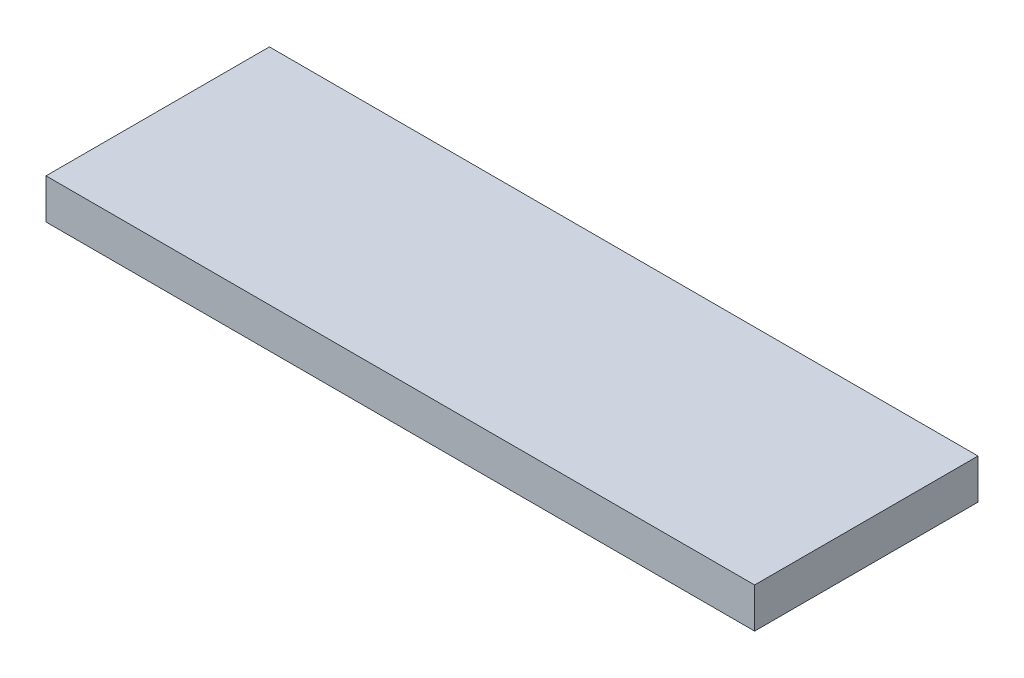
ISO-10303-21;
HEADER;
FILE_DESCRIPTION(('STEP AP214'),'2;1');
FILE_NAME('part.step','',(''),(''),'','','');
FILE_SCHEMA(('AUTOMOTIVE_DESIGN { 1 0 10303 214 1 1 1 1 }'));
ENDSEC;
DATA;
#1=APPLICATION_CONTEXT('core data for automotive mechanical design processes');
#2=APPLICATION_PROTOCOL_DEFINITION('international standard','automotive_design',2000,#1);
#3=PRODUCT_CONTEXT('',#1,'mechanical');
#4=PRODUCT('Part','Part','',(#3));
#5=PRODUCT_RELATED_PRODUCT_CATEGORY('part','',(#4));
#6=PRODUCT_DEFINITION_FORMATION('','',#4);
#7=PRODUCT_DEFINITION_CONTEXT('part definition',#1,'design');
#8=PRODUCT_DEFINITION('design','',#6,#7);
#9=PRODUCT_DEFINITION_SHAPE('','',#8);
#10=(LENGTH_UNIT() NAMED_UNIT(*) SI_UNIT(.MILLI.,.METRE.));
#11=(NAMED_UNIT(*) PLANE_ANGLE_UNIT() SI_UNIT($,.RADIAN.));
#12=(NAMED_UNIT(*) SI_UNIT($,.STERADIAN.) SOLID_ANGLE_UNIT());
#13=UNCERTAINTY_MEASURE_WITH_UNIT(LENGTH_MEASURE(1.E-05),#10,'distance_accuracy_value','');
#14=(GEOMETRIC_REPRESENTATION_CONTEXT(3) GLOBAL_UNCERTAINTY_ASSIGNED_CONTEXT((#13)) GLOBAL_UNIT_ASSIGNED_CONTEXT((#10,
#11,#12)) REPRESENTATION_CONTEXT('',''));
#15=CARTESIAN_POINT('',(0.,0.,0.));
#16=DIRECTION('',(0.,0.,1.));
#17=DIRECTION('',(1.,0.,0.));
#18=AXIS2_PLACEMENT_3D('',#15,#16,#17);
#19=CARTESIAN_POINT('',(0.,0.,131.064));
#20=DIRECTION('',(1.,0.,0.));
#21=DIRECTION('',(0.,0.,-1.));
#22=AXIS2_PLACEMENT_3D('',#19,#20,#21);
#23=PLANE('',#22);
#24=DIRECTION('',(0.,-1.,0.));
#25=VECTOR('',#24,1.);
#26=CARTESIAN_POINT('',(0.,0.,0.));
#27=LINE('',#26,#25);
#28=CARTESIAN_POINT('',(0.,23.458279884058,0.));
#29=VERTEX_POINT('',#28);
#30=CARTESIAN_POINT('',(0.,0.,0.));
#31=VERTEX_POINT('',#30);
#32=EDGE_CURVE('E94',#29,#31,#27,.T.);
#33=ORIENTED_EDGE('',*,*,#32,.T.);
#34=DIRECTION('',(0.,0.,-1.));
#35=VECTOR('',#34,1.);
#36=CARTESIAN_POINT('',(0.,0.,131.064));
#37=LINE('',#36,#35);
#38=CARTESIAN_POINT('',(0.,0.,131.064));
#39=VERTEX_POINT('',#38);
#40=EDGE_CURVE('E11',#39,#31,#37,.T.);
#41=ORIENTED_EDGE('',*,*,#40,.F.);
#42=DIRECTION('',(0.,-1.,0.));
#43=VECTOR('',#42,1.);
#44=CARTESIAN_POINT('',(0.,0.,131.064));
#45=LINE('',#44,#43);
#46=CARTESIAN_POINT('',(0.,23.458279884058,131.064));
#47=VERTEX_POINT('',#46);
#48=EDGE_CURVE('E82',#47,#39,#45,.T.);
#49=ORIENTED_EDGE('',*,*,#48,.F.);
#50=DIRECTION('',(0.,0.,-1.));
#51=VECTOR('',#50,1.);
#52=CARTESIAN_POINT('',(0.,23.458279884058,131.064));
#53=LINE('',#52,#51);
#54=EDGE_CURVE('E90',#47,#29,#53,.T.);
#55=ORIENTED_EDGE('',*,*,#54,.T.);
#56=EDGE_LOOP('',(#33,#41,#49,#55));
#57=FACE_BOUND('',#56,.T.);
#58=ADVANCED_FACE('F31',(#57),#23,.F.);
#59=CARTESIAN_POINT('',(0.,0.,131.064));
#60=DIRECTION('',(0.,1.,0.));
#61=DIRECTION('',(0.,0.,1.));
#62=AXIS2_PLACEMENT_3D('',#59,#60,#61);
#63=PLANE('',#62);
#64=DIRECTION('',(1.,0.,0.));
#65=VECTOR('',#64,1.);
#66=CARTESIAN_POINT('',(0.,0.,0.));
#67=LINE('',#66,#65);
#68=CARTESIAN_POINT('',(415.761360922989,0.,0.));
#69=VERTEX_POINT('',#68);
#70=EDGE_CURVE('E86',#31,#69,#67,.T.);
#71=ORIENTED_EDGE('',*,*,#70,.T.);
#72=DIRECTION('',(0.,0.,-1.));
#73=VECTOR('',#72,1.);
#74=CARTESIAN_POINT('',(415.761360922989,0.,131.064));
#75=LINE('',#74,#73);
#76=CARTESIAN_POINT('',(415.761360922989,0.,131.064));
#77=VERTEX_POINT('',#76);
#78=EDGE_CURVE('E39',#77,#69,#75,.T.);
#79=ORIENTED_EDGE('',*,*,#78,.F.);
#80=DIRECTION('',(1.,0.,0.));
#81=VECTOR('',#80,1.);
#82=CARTESIAN_POINT('',(0.,0.,131.064));
#83=LINE('',#82,#81);
#84=EDGE_CURVE('E77',#39,#77,#83,.T.);
#85=ORIENTED_EDGE('',*,*,#84,.F.);
#86=ORIENTED_EDGE('',*,*,#40,.T.);
#87=EDGE_LOOP('',(#71,#79,#85,#86));
#88=FACE_BOUND('',#87,.T.);
#89=ADVANCED_FACE('F85',(#88),#63,.F.);
#90=CARTESIAN_POINT('',(415.761360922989,0.,131.064));
#91=DIRECTION('',(-1.,0.,0.));
#92=DIRECTION('',(0.,0.,1.));
#93=AXIS2_PLACEMENT_3D('',#90,#91,#92);
#94=PLANE('',#93);
#95=DIRECTION('',(0.,1.,0.));
#96=VECTOR('',#95,1.);
#97=CARTESIAN_POINT('',(415.761360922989,0.,0.));
#98=LINE('',#97,#96);
#99=CARTESIAN_POINT('',(415.761360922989,23.458279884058,0.));
#100=VERTEX_POINT('',#99);
#101=EDGE_CURVE('E64',#69,#100,#98,.T.);
#102=ORIENTED_EDGE('',*,*,#101,.T.);
#103=DIRECTION('',(0.,0.,-1.));
#104=VECTOR('',#103,1.);
#105=CARTESIAN_POINT('',(415.761360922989,23.458279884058,131.064));
#106=LINE('',#105,#104);
#107=CARTESIAN_POINT('',(415.761360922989,23.458279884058,131.064));
#108=VERTEX_POINT('',#107);
#109=EDGE_CURVE('E87',#108,#100,#106,.T.);
#110=ORIENTED_EDGE('',*,*,#109,.F.);
#111=DIRECTION('',(0.,1.,0.));
#112=VECTOR('',#111,1.);
#113=CARTESIAN_POINT('',(415.761360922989,0.,131.064));
#114=LINE('',#113,#112);
#115=EDGE_CURVE('E80',#77,#108,#114,.T.);
#116=ORIENTED_EDGE('',*,*,#115,.F.);
#117=ORIENTED_EDGE('',*,*,#78,.T.);
#118=EDGE_LOOP('',(#102,#110,#116,#117));
#119=FACE_BOUND('',#118,.T.);
#120=ADVANCED_FACE('F88',(#119),#94,.F.);
#121=CARTESIAN_POINT('',(0.,23.458279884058,131.064));
#122=DIRECTION('',(0.,-1.,0.));
#123=DIRECTION('',(0.,0.,-1.));
#124=AXIS2_PLACEMENT_3D('',#121,#122,#123);
#125=PLANE('',#124);
#126=DIRECTION('',(-1.,0.,0.));
#127=VECTOR('',#126,1.);
#128=CARTESIAN_POINT('',(0.,23.458279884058,0.));
#129=LINE('',#128,#127);
#130=EDGE_CURVE('E70',#100,#29,#129,.T.);
#131=ORIENTED_EDGE('',*,*,#130,.T.);
#132=ORIENTED_EDGE('',*,*,#54,.F.);
#133=DIRECTION('',(-1.,0.,0.));
#134=VECTOR('',#133,1.);
#135=CARTESIAN_POINT('',(0.,23.458279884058,131.064));
#136=LINE('',#135,#134);
#137=EDGE_CURVE('E47',#108,#47,#136,.T.);
#138=ORIENTED_EDGE('',*,*,#137,.F.);
#139=ORIENTED_EDGE('',*,*,#109,.T.);
#140=EDGE_LOOP('',(#131,#132,#138,#139));
#141=FACE_BOUND('',#140,.T.);
#142=ADVANCED_FACE('F101',(#141),#125,.F.);
#143=CARTESIAN_POINT('',(0.,23.458279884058,131.064));
#144=DIRECTION('',(0.,0.,-1.));
#145=DIRECTION('',(-1.,0.,0.));
#146=AXIS2_PLACEMENT_3D('',#143,#144,#145);
#147=PLANE('',#146);
#148=ORIENTED_EDGE('',*,*,#48,.T.);
#149=ORIENTED_EDGE('',*,*,#84,.T.);
#150=ORIENTED_EDGE('',*,*,#115,.T.);
#151=ORIENTED_EDGE('',*,*,#137,.T.);
#152=EDGE_LOOP('',(#148,#149,#150,#151));
#153=FACE_BOUND('',#152,.T.);
#154=ADVANCED_FACE('F78',(#153),#147,.F.);
#155=CARTESIAN_POINT('',(0.,23.458279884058,0.));
#156=DIRECTION('',(0.,0.,-1.));
#157=DIRECTION('',(-1.,0.,0.));
#158=AXIS2_PLACEMENT_3D('',#155,#156,#157);
#159=PLANE('',#158);
#160=ORIENTED_EDGE('',*,*,#32,.F.);
#161=ORIENTED_EDGE('',*,*,#130,.F.);
#162=ORIENTED_EDGE('',*,*,#101,.F.);
#163=ORIENTED_EDGE('',*,*,#70,.F.);
#164=EDGE_LOOP('',(#160,#161,#162,#163));
#165=FACE_BOUND('',#164,.T.);
#166=ADVANCED_FACE('F104',(#165),#159,.T.);
#167=CLOSED_SHELL('',(#58,#89,#120,#142,#154,#166));
#168=MANIFOLD_SOLID_BREP('B2',#167);
#169=ADVANCED_BREP_SHAPE_REPRESENTATION('',(#18,#168),#14);
#170=SHAPE_DEFINITION_REPRESENTATION(#9,#169);
ENDSEC;
END-ISO-10303-21;
